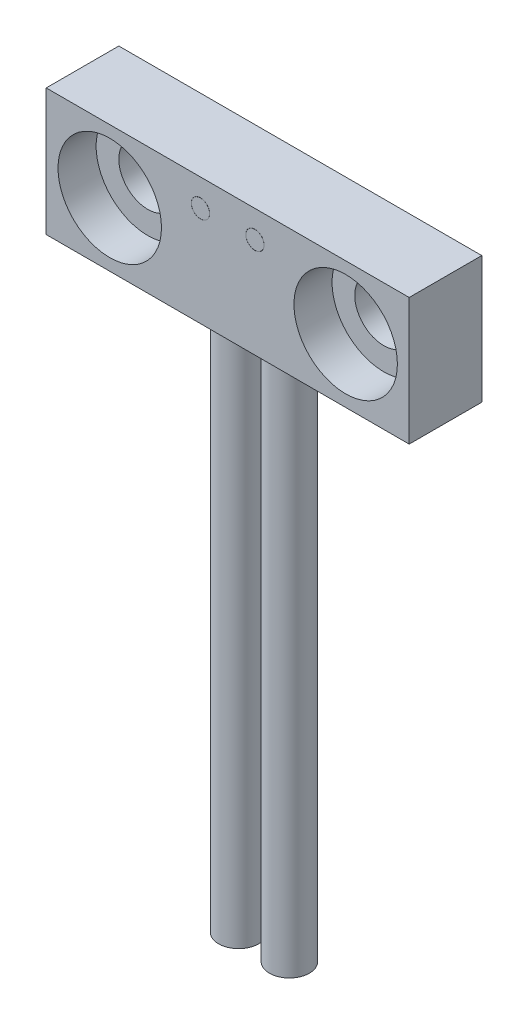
from build123d import *

# Parameters (mm, degrees)
SKETCH_1_W                = 20
SKETCH_1_H                = 7
EXTRUDE_1_DEPTH           = 2
HOLE_WIZARD_1_D           = 3.2
HOLE_WIZARD_1_CBORE_D     = 5.7
HOLE_WIZARD_1_CBORE_DEPTH = 2.1
SKETCH_9_R                = 1.1
EXTRUDE_2_DEPTH           = 30
SKETCH_8_R                = 0.505
SKETCH_8_R_2              = 0.5
CUT_EXTRUDE_1_DEPTH       = 0.1


with BuildPart() as part:
    # Sketch 1 → Extrude 1 (new, symmetric)
    with BuildSketch(Plane.XY):
        Rectangle(SKETCH_1_W, SKETCH_1_H)
    extrude(amount=EXTRUDE_1_DEPTH, both=True)

    # Hole Wizard 1 (through all)
    with Locations(Plane.XY.offset(2)):
        with Locations((-6.5, 0), (6.5, 0)):
            CounterBoreHole(HOLE_WIZARD_1_D / 2, HOLE_WIZARD_1_CBORE_D / 2, HOLE_WIZARD_1_CBORE_DEPTH)

    # Sketch 9 → Extrude 2 (add)
    with BuildSketch(Plane.XZ.offset(3.5)):
        with Locations(Location((1.4, 0, 0), (0, 0, 180))):
            Circle(SKETCH_9_R)
        with Locations(Location((-1.4, 0, 0), (0, 0, 180))):
            Circle(SKETCH_9_R)
    extrude(amount=EXTRUDE_2_DEPTH)

    # Sketch 8 → Cut-Extrude 1 (cut)
    # profile 1 of 2: a face of its own
    with BuildSketch(Plane.XY.offset(2)):
        with Locations((-1.5, 2)):
            Circle(SKETCH_8_R)
        with Locations((-1.5, 2)):
            Circle(SKETCH_8_R_2, mode=Mode.SUBTRACT)
    # profile 2 of 2: a face of its own
    with BuildSketch(Plane.XY.offset(2)):
        with Locations((1.5, 2)):
            Circle(SKETCH_8_R)
        with Locations((1.5, 2)):
            Circle(SKETCH_8_R_2, mode=Mode.SUBTRACT)
    extrude(amount=-CUT_EXTRUDE_1_DEPTH, mode=Mode.SUBTRACT)


solid = part.part
